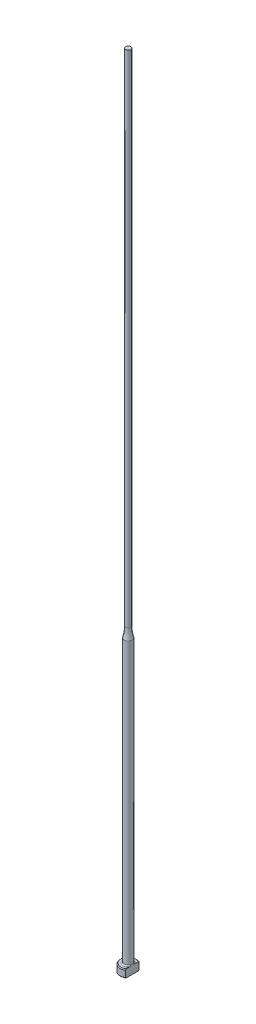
from build123d import *
from build123d.topology import SkipClean

# Parameters (mm, degrees)
CHAMFER1_SIZE = 0.2
FILLET1_R     = 0.3
KEY_DEPTH     = 201.019999


with BuildPart() as part:
    # Sketch1 → Revolve1 (revolve)
    with BuildSketch(Plane.XY, mode=Mode.PRIVATE) as revolve1_sk:
        with BuildLine():
            Line((0, 0), (-2, 0))
            Line((-2, 0), (-2, 2))
            Line((-2, 2), (-1, 2))
            Line((-1, 2), (-1, 72.377501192))
            ThreePointArc((-1, 72.377501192), (-0.737886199, 73.677124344), (-0.65, 75))
            Line((-0.65, 75), (-0.65, 200))
            Line((-0.65, 200), (0, 200))
            Line((0, 200), (0, 0))
        make_face()
    revolve(revolve1_sk.sketch.rotate(Axis((0, 259.958771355, 0), (0, -1, 0)), 270), axis=Axis((0, 259.958771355, 0), (0, -1, 0)))

    # Chamfer1
    chamfer1_edges = [part.edges().sort_by_distance(p)[0] for p in [
        (0, 0, -2),
        (0, 2, -2),
    ]]
    chamfer(chamfer1_edges, length=CHAMFER1_SIZE)

    # Fillet1
    fillet1_edges = [part.edges().sort_by_distance(p)[0] for p in [
        (0, 2, -1),
    ]]
    fillet(fillet1_edges, radius=FILLET1_R)

    # Sketch2 → KEY (cut, through all)
    with SkipClean():  # the faces are left unmerged after this step: merging them gives an invalid solid
        with BuildSketch(Plane(origin=(0, 0, 0), x_dir=(1, 0, 0), z_dir=(0, 1, 0))):
            with BuildLine():
                Line((1, 1.732050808), (1, -1.732050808))
                ThreePointArc((1, -1.732050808), (2, 0), (1, 1.732050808))
            make_face()
        extrude(amount=KEY_DEPTH, mode=Mode.SUBTRACT)


solid = part.part
